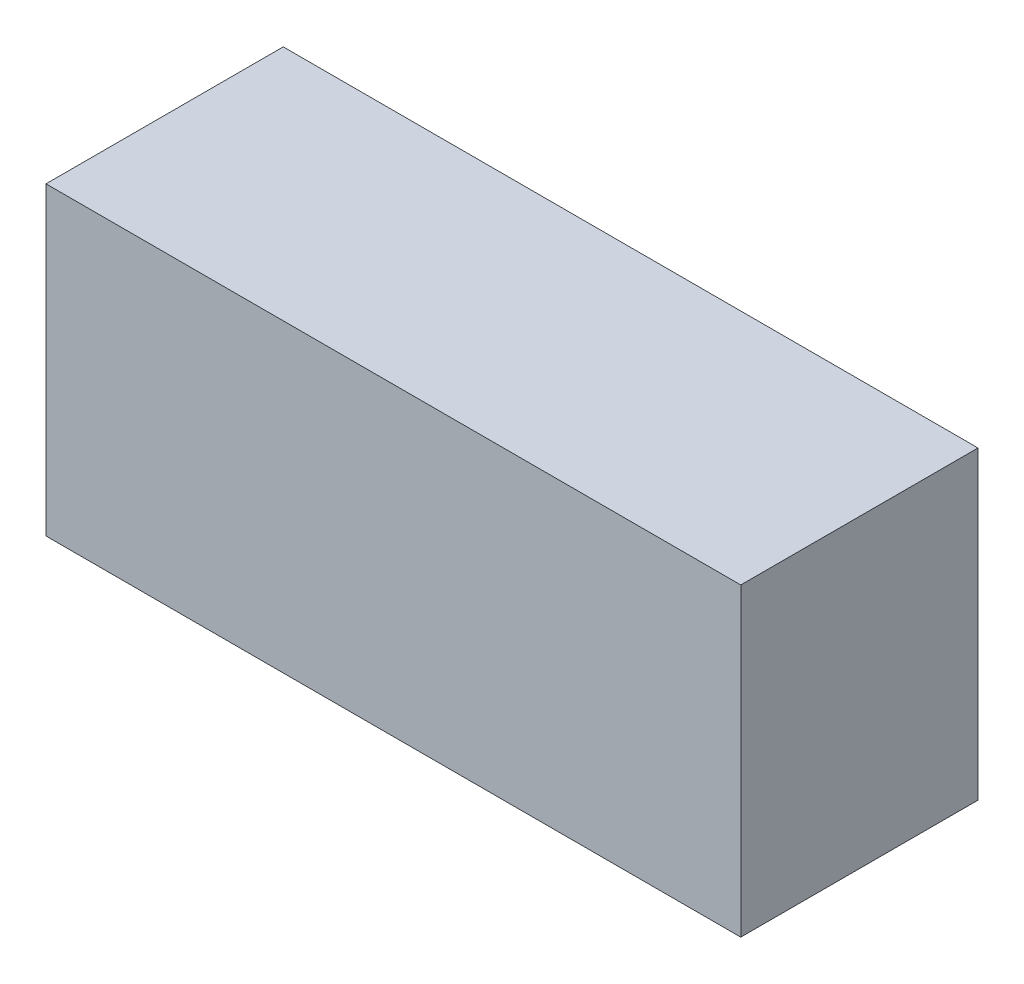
ISO-10303-21;
HEADER;
FILE_DESCRIPTION(('STEP AP214'),'2;1');
FILE_NAME('part.step','',(''),(''),'','','');
FILE_SCHEMA(('AUTOMOTIVE_DESIGN { 1 0 10303 214 1 1 1 1 }'));
ENDSEC;
DATA;
#1=APPLICATION_CONTEXT('core data for automotive mechanical design processes');
#2=APPLICATION_PROTOCOL_DEFINITION('international standard','automotive_design',2000,#1);
#3=PRODUCT_CONTEXT('',#1,'mechanical');
#4=PRODUCT('Part','Part','',(#3));
#5=PRODUCT_RELATED_PRODUCT_CATEGORY('part','',(#4));
#6=PRODUCT_DEFINITION_FORMATION('','',#4);
#7=PRODUCT_DEFINITION_CONTEXT('part definition',#1,'design');
#8=PRODUCT_DEFINITION('design','',#6,#7);
#9=PRODUCT_DEFINITION_SHAPE('','',#8);
#10=(LENGTH_UNIT() NAMED_UNIT(*) SI_UNIT(.MILLI.,.METRE.));
#11=(NAMED_UNIT(*) PLANE_ANGLE_UNIT() SI_UNIT($,.RADIAN.));
#12=(NAMED_UNIT(*) SI_UNIT($,.STERADIAN.) SOLID_ANGLE_UNIT());
#13=UNCERTAINTY_MEASURE_WITH_UNIT(LENGTH_MEASURE(1.E-05),#10,'distance_accuracy_value','');
#14=(GEOMETRIC_REPRESENTATION_CONTEXT(3) GLOBAL_UNCERTAINTY_ASSIGNED_CONTEXT((#13)) GLOBAL_UNIT_ASSIGNED_CONTEXT((#10,
#11,#12)) REPRESENTATION_CONTEXT('',''));
#15=CARTESIAN_POINT('',(0.,0.,0.));
#16=DIRECTION('',(0.,0.,1.));
#17=DIRECTION('',(1.,0.,0.));
#18=AXIS2_PLACEMENT_3D('',#15,#16,#17);
#19=CARTESIAN_POINT('',(0.,0.,7.));
#20=DIRECTION('',(1.,0.,0.));
#21=DIRECTION('',(0.,1.,0.));
#22=AXIS2_PLACEMENT_3D('',#19,#20,#21);
#23=PLANE('',#22);
#24=DIRECTION('',(0.,-1.,0.));
#25=VECTOR('',#24,1.);
#26=CARTESIAN_POINT('',(0.,0.,0.));
#27=LINE('',#26,#25);
#28=CARTESIAN_POINT('',(0.,9.,0.));
#29=VERTEX_POINT('',#28);
#30=CARTESIAN_POINT('',(0.,0.,0.));
#31=VERTEX_POINT('',#30);
#32=EDGE_CURVE('E70',#29,#31,#27,.T.);
#33=ORIENTED_EDGE('',*,*,#32,.T.);
#34=DIRECTION('',(0.,0.,-1.));
#35=VECTOR('',#34,1.);
#36=CARTESIAN_POINT('',(0.,0.,7.));
#37=LINE('',#36,#35);
#38=CARTESIAN_POINT('',(0.,0.,7.));
#39=VERTEX_POINT('',#38);
#40=EDGE_CURVE('E11',#39,#31,#37,.T.);
#41=ORIENTED_EDGE('',*,*,#40,.F.);
#42=DIRECTION('',(0.,-1.,0.));
#43=VECTOR('',#42,1.);
#44=CARTESIAN_POINT('',(0.,0.,7.));
#45=LINE('',#44,#43);
#46=CARTESIAN_POINT('',(0.,9.,7.));
#47=VERTEX_POINT('',#46);
#48=EDGE_CURVE('E88',#47,#39,#45,.T.);
#49=ORIENTED_EDGE('',*,*,#48,.F.);
#50=DIRECTION('',(0.,0.,-1.));
#51=VECTOR('',#50,1.);
#52=CARTESIAN_POINT('',(0.,9.,7.));
#53=LINE('',#52,#51);
#54=EDGE_CURVE('E82',#47,#29,#53,.T.);
#55=ORIENTED_EDGE('',*,*,#54,.T.);
#56=EDGE_LOOP('',(#33,#41,#49,#55));
#57=FACE_BOUND('',#56,.T.);
#58=ADVANCED_FACE('F26',(#57),#23,.F.);
#59=CARTESIAN_POINT('',(0.,0.,7.));
#60=DIRECTION('',(0.,1.,0.));
#61=DIRECTION('',(0.,0.,1.));
#62=AXIS2_PLACEMENT_3D('',#59,#60,#61);
#63=PLANE('',#62);
#64=DIRECTION('',(1.,0.,0.));
#65=VECTOR('',#64,1.);
#66=CARTESIAN_POINT('',(0.,0.,0.));
#67=LINE('',#66,#65);
#68=CARTESIAN_POINT('',(20.5,0.,0.));
#69=VERTEX_POINT('',#68);
#70=EDGE_CURVE('E66',#31,#69,#67,.T.);
#71=ORIENTED_EDGE('',*,*,#70,.T.);
#72=DIRECTION('',(0.,0.,-1.));
#73=VECTOR('',#72,1.);
#74=CARTESIAN_POINT('',(20.5,0.,7.));
#75=LINE('',#74,#73);
#76=CARTESIAN_POINT('',(20.5,0.,7.));
#77=VERTEX_POINT('',#76);
#78=EDGE_CURVE('E33',#77,#69,#75,.T.);
#79=ORIENTED_EDGE('',*,*,#78,.F.);
#80=DIRECTION('',(1.,0.,0.));
#81=VECTOR('',#80,1.);
#82=CARTESIAN_POINT('',(0.,0.,7.));
#83=LINE('',#82,#81);
#84=EDGE_CURVE('E78',#39,#77,#83,.T.);
#85=ORIENTED_EDGE('',*,*,#84,.F.);
#86=ORIENTED_EDGE('',*,*,#40,.T.);
#87=EDGE_LOOP('',(#71,#79,#85,#86));
#88=FACE_BOUND('',#87,.T.);
#89=ADVANCED_FACE('F77',(#88),#63,.F.);
#90=CARTESIAN_POINT('',(20.5,0.,7.));
#91=DIRECTION('',(-1.,0.,0.));
#92=DIRECTION('',(0.,-1.,0.));
#93=AXIS2_PLACEMENT_3D('',#90,#91,#92);
#94=PLANE('',#93);
#95=DIRECTION('',(0.,1.,0.));
#96=VECTOR('',#95,1.);
#97=CARTESIAN_POINT('',(20.5,0.,0.));
#98=LINE('',#97,#96);
#99=CARTESIAN_POINT('',(20.5,9.,0.));
#100=VERTEX_POINT('',#99);
#101=EDGE_CURVE('E71',#69,#100,#98,.T.);
#102=ORIENTED_EDGE('',*,*,#101,.T.);
#103=DIRECTION('',(0.,0.,-1.));
#104=VECTOR('',#103,1.);
#105=CARTESIAN_POINT('',(20.5,9.,7.));
#106=LINE('',#105,#104);
#107=CARTESIAN_POINT('',(20.5,9.,7.));
#108=VERTEX_POINT('',#107);
#109=EDGE_CURVE('E94',#108,#100,#106,.T.);
#110=ORIENTED_EDGE('',*,*,#109,.F.);
#111=DIRECTION('',(0.,1.,0.));
#112=VECTOR('',#111,1.);
#113=CARTESIAN_POINT('',(20.5,0.,7.));
#114=LINE('',#113,#112);
#115=EDGE_CURVE('E45',#77,#108,#114,.T.);
#116=ORIENTED_EDGE('',*,*,#115,.F.);
#117=ORIENTED_EDGE('',*,*,#78,.T.);
#118=EDGE_LOOP('',(#102,#110,#116,#117));
#119=FACE_BOUND('',#118,.T.);
#120=ADVANCED_FACE('F97',(#119),#94,.F.);
#121=CARTESIAN_POINT('',(0.,9.,7.));
#122=DIRECTION('',(0.,-1.,0.));
#123=DIRECTION('',(0.,0.,-1.));
#124=AXIS2_PLACEMENT_3D('',#121,#122,#123);
#125=PLANE('',#124);
#126=DIRECTION('',(-1.,0.,0.));
#127=VECTOR('',#126,1.);
#128=CARTESIAN_POINT('',(0.,9.,0.));
#129=LINE('',#128,#127);
#130=EDGE_CURVE('E86',#100,#29,#129,.T.);
#131=ORIENTED_EDGE('',*,*,#130,.T.);
#132=ORIENTED_EDGE('',*,*,#54,.F.);
#133=DIRECTION('',(-1.,0.,0.));
#134=VECTOR('',#133,1.);
#135=CARTESIAN_POINT('',(0.,9.,7.));
#136=LINE('',#135,#134);
#137=EDGE_CURVE('E40',#108,#47,#136,.T.);
#138=ORIENTED_EDGE('',*,*,#137,.F.);
#139=ORIENTED_EDGE('',*,*,#109,.T.);
#140=EDGE_LOOP('',(#131,#132,#138,#139));
#141=FACE_BOUND('',#140,.T.);
#142=ADVANCED_FACE('F99',(#141),#125,.F.);
#143=CARTESIAN_POINT('',(0.,9.,7.));
#144=DIRECTION('',(0.,0.,-1.));
#145=DIRECTION('',(-1.,0.,0.));
#146=AXIS2_PLACEMENT_3D('',#143,#144,#145);
#147=PLANE('',#146);
#148=ORIENTED_EDGE('',*,*,#48,.T.);
#149=ORIENTED_EDGE('',*,*,#84,.T.);
#150=ORIENTED_EDGE('',*,*,#115,.T.);
#151=ORIENTED_EDGE('',*,*,#137,.T.);
#152=EDGE_LOOP('',(#148,#149,#150,#151));
#153=FACE_BOUND('',#152,.T.);
#154=ADVANCED_FACE('F100',(#153),#147,.F.);
#155=CARTESIAN_POINT('',(0.,9.,0.));
#156=DIRECTION('',(0.,0.,-1.));
#157=DIRECTION('',(-1.,0.,0.));
#158=AXIS2_PLACEMENT_3D('',#155,#156,#157);
#159=PLANE('',#158);
#160=ORIENTED_EDGE('',*,*,#32,.F.);
#161=ORIENTED_EDGE('',*,*,#130,.F.);
#162=ORIENTED_EDGE('',*,*,#101,.F.);
#163=ORIENTED_EDGE('',*,*,#70,.F.);
#164=EDGE_LOOP('',(#160,#161,#162,#163));
#165=FACE_BOUND('',#164,.T.);
#166=ADVANCED_FACE('F67',(#165),#159,.T.);
#167=CLOSED_SHELL('',(#58,#89,#120,#142,#154,#166));
#168=MANIFOLD_SOLID_BREP('B2',#167);
#169=ADVANCED_BREP_SHAPE_REPRESENTATION('',(#18,#168),#14);
#170=SHAPE_DEFINITION_REPRESENTATION(#9,#169);
ENDSEC;
END-ISO-10303-21;
